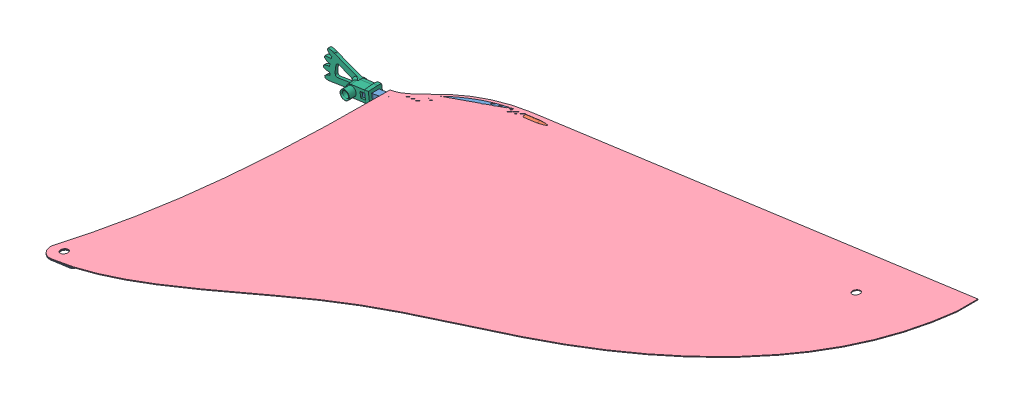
SolidWorks assembly WING_RIGHT.sldasm, configuration Default (file format 11000). Lengths in mm.
Overall size (173.27 34.92 102.67).
6 component instances, 6 part files, 3 mates.
Components (placement in the parent):
- WING_STRUCT_RIGHTa-1: WING_STRUCT_RIGHTa.sldprt [Défaut] at origin size (38.09 7.64 13.78)
- WING_CONNECTOR-1: WING_CONNECTOR.sldprt [Default] at origin size (8.12 2.43 1.7)
- CRP_POLE_06_WING-1: CRP_POLE_06_WING.sldprt [Default] at origin size (115 16.42 0.61)
- WING_FILM_RIGHT-1: WING_FILM_RIGHT.sldprt [Default] at origin size (168.44 34.49 102.67)
- MYLAR_WASHER-1: MYLAR_WASHER.sldprt [Default] at origin size (9.43 1.44 10)
- ROCKER_RIGHT-1: ROCKER_RIGHT.sldprt [Default] at (0.7512 -3.079 0.05) x (0.938549 0.345146 0) z (0 0 1) size (15.07 10.25 5.51)
Mates (geometry in assembly coordinates):
- Coïncidente1: coincident: plane of WING_STRUCT_RIGHTa-1 through (9.4725 1.0745 -2.0612) normal (-0.136364 0.990659 0); plane of ROCKER_RIGHT-1 through (10.0722 1.157 -4.34) normal (0.136364 -0.990659 0)
- Coïncidente2: coincident: line of WING_STRUCT_RIGHTa-1 through (10.1515 1.1679 -4.3) axis (0.990659 0.136364 0); line of ROCKER_RIGHT-1 through (10.1515 1.1679 -4.3) axis (0.990659 0.136364 0)
- Coïncidente3: coincident: line of WING_STRUCT_RIGHTa-1 through (10.1515 1.1679 -2.3) axis (0 0 -1); plane of ROCKER_RIGHT-1 through (10.4297 -0.853 -4.34) normal (0.990659 0.136364 0)
